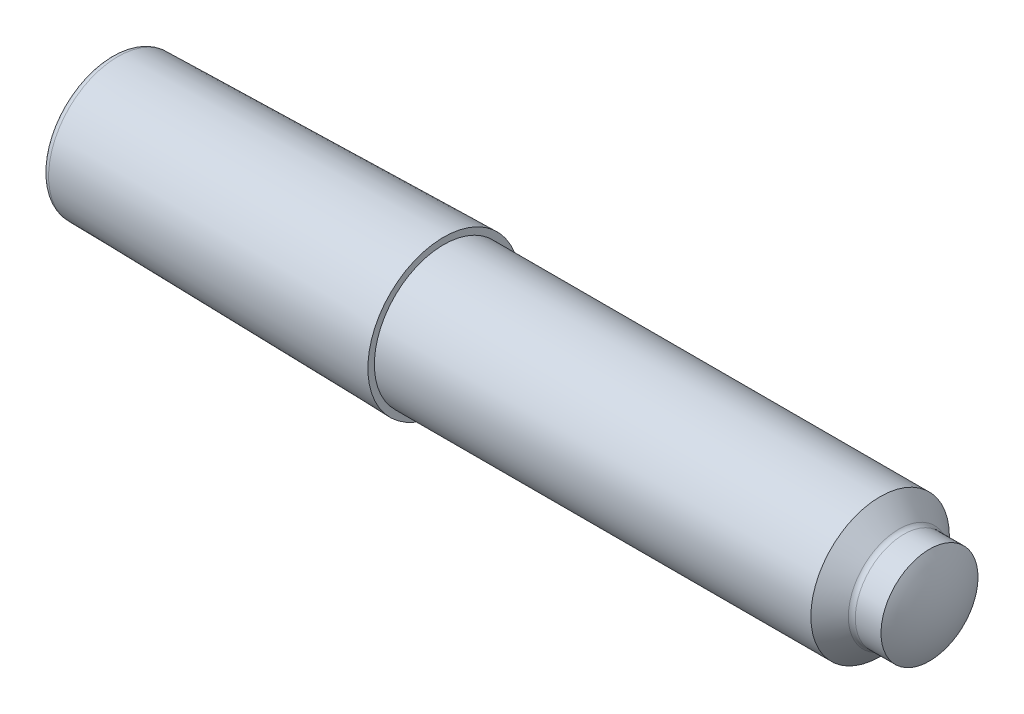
from build123d import *

# Parameters (mm, degrees)
FILLET1_R = 0.25


with BuildPart() as part:
    # Sketch1 → Body (revolve)
    with BuildSketch(Plane.XY, mode=Mode.PRIVATE) as body_sk:
        with BuildLine():
            Line((0, 0), (0, 2.250049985))
            ThreePointArc((0, 2.250049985), (0.071464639, 2.425050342), (0.245001, 2.5))
            Line((0.245001, 2.5), (12, 2.73509998))
            Line((12, 2.73509998), (12, 2.5))
            Line((12, 2.5), (14.4, 2.5))
            Line((14.4, 2.5), (27.75, 2.5))
            Line((27.75, 2.5), (28.5, 1.75))
            Line((28.5, 1.75), (29.531088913, 1.75))
            ThreePointArc((29.531088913, 1.75), (29.880740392, 0.905866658), (30, 0))
            Line((30, 0), (0, 0))
        make_face()
    revolve(body_sk.sketch.rotate(Axis((0, 0, 0), (-1, 0, 0)), 90), axis=Axis((0, 0, 0), (-1, 0, 0)))

    # Fillet1
    fillet1_edges = [part.edges().sort_by_distance(p)[0] for p in [
        (28.5, 0, 1.75),
    ]]
    fillet(fillet1_edges, radius=FILLET1_R)


solid = part.part
